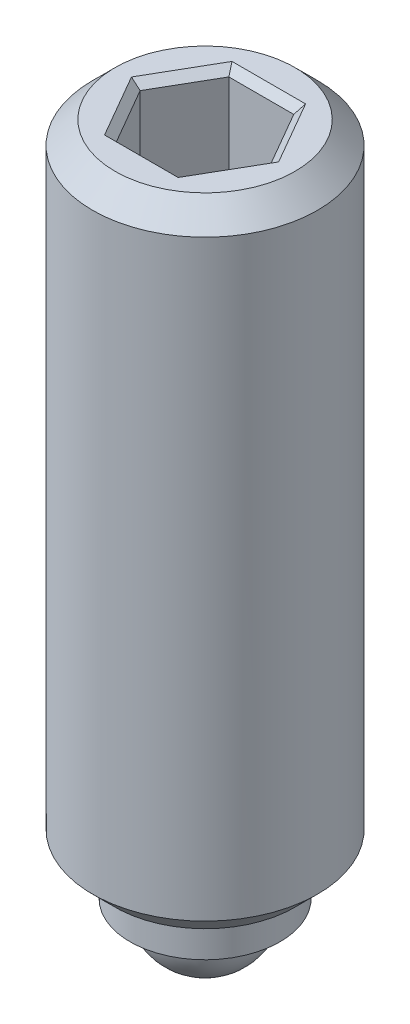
ISO-10303-21;
HEADER;
FILE_DESCRIPTION(('STEP AP214'),'2;1');
FILE_NAME('part.step','',(''),(''),'','','');
FILE_SCHEMA(('AUTOMOTIVE_DESIGN { 1 0 10303 214 1 1 1 1 }'));
ENDSEC;
DATA;
#1=APPLICATION_CONTEXT('core data for automotive mechanical design processes');
#2=APPLICATION_PROTOCOL_DEFINITION('international standard','automotive_design',2000,#1);
#3=PRODUCT_CONTEXT('',#1,'mechanical');
#4=PRODUCT('Part','Part','',(#3));
#5=PRODUCT_RELATED_PRODUCT_CATEGORY('part','',(#4));
#6=PRODUCT_DEFINITION_FORMATION('','',#4);
#7=PRODUCT_DEFINITION_CONTEXT('part definition',#1,'design');
#8=PRODUCT_DEFINITION('design','',#6,#7);
#9=PRODUCT_DEFINITION_SHAPE('','',#8);
#10=(LENGTH_UNIT() NAMED_UNIT(*) SI_UNIT(.MILLI.,.METRE.));
#11=(NAMED_UNIT(*) PLANE_ANGLE_UNIT() SI_UNIT($,.RADIAN.));
#12=(NAMED_UNIT(*) SI_UNIT($,.STERADIAN.) SOLID_ANGLE_UNIT());
#13=UNCERTAINTY_MEASURE_WITH_UNIT(LENGTH_MEASURE(1.E-05),#10,'distance_accuracy_value','');
#14=(GEOMETRIC_REPRESENTATION_CONTEXT(3) GLOBAL_UNCERTAINTY_ASSIGNED_CONTEXT((#13)) GLOBAL_UNIT_ASSIGNED_CONTEXT((#10,
#11,#12)) REPRESENTATION_CONTEXT('',''));
#15=CARTESIAN_POINT('',(0.,0.,0.));
#16=DIRECTION('',(0.,0.,1.));
#17=DIRECTION('',(1.,0.,0.));
#18=AXIS2_PLACEMENT_3D('',#15,#16,#17);
#19=CARTESIAN_POINT('',(1.,0.,0.));
#20=DIRECTION('',(0.,-1.,0.));
#21=DIRECTION('',(0.,0.,-1.));
#22=AXIS2_PLACEMENT_3D('',#19,#20,#21);
#23=PLANE('',#22);
#24=CARTESIAN_POINT('',(0.,0.,0.));
#25=DIRECTION('',(0.,-1.,0.));
#26=DIRECTION('',(0.,0.,-1.));
#27=AXIS2_PLACEMENT_3D('',#24,#25,#26);
#28=CIRCLE('',#27,0.75);
#29=CARTESIAN_POINT('',(0.,0.,-0.75));
#30=VERTEX_POINT('',#29);
#31=EDGE_CURVE('E166',#30,#30,#28,.T.);
#32=ORIENTED_EDGE('',*,*,#31,.F.);
#33=EDGE_LOOP('',(#32));
#34=FACE_BOUND('',#33,.T.);
#35=CARTESIAN_POINT('',(0.,0.,0.));
#36=DIRECTION('',(0.,-1.,0.));
#37=DIRECTION('',(0.,0.,-1.));
#38=AXIS2_PLACEMENT_3D('',#35,#36,#37);
#39=CIRCLE('',#38,1.);
#40=CARTESIAN_POINT('',(0.,0.,-1.));
#41=VERTEX_POINT('',#40);
#42=EDGE_CURVE('E152',#41,#41,#39,.T.);
#43=ORIENTED_EDGE('',*,*,#42,.T.);
#44=EDGE_LOOP('',(#43));
#45=FACE_BOUND('',#44,.T.);
#46=ADVANCED_FACE('F41',(#34,#45),#23,.T.);
#47=CARTESIAN_POINT('',(0.,9.,0.));
#48=DIRECTION('',(0.,1.,0.));
#49=DIRECTION('',(0.,0.,1.));
#50=AXIS2_PLACEMENT_3D('',#47,#48,#49);
#51=PLANE('',#50);
#52=DIRECTION('',(1.,0.,0.));
#53=VECTOR('',#52,1.);
#54=CARTESIAN_POINT('',(0.433012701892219,9.,-0.849999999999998));
#55=LINE('',#54,#53);
#56=CARTESIAN_POINT('',(-0.490747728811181,9.,-0.849999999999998));
#57=VERTEX_POINT('',#56);
#58=CARTESIAN_POINT('',(0.490747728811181,9.,-0.849999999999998));
#59=VERTEX_POINT('',#58);
#60=EDGE_CURVE('E191',#57,#59,#55,.T.);
#61=ORIENTED_EDGE('',*,*,#60,.T.);
#62=DIRECTION('',(0.5,0.,0.866025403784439));
#63=VECTOR('',#62,1.);
#64=CARTESIAN_POINT('',(0.952627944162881,9.,-0.0499999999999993));
#65=LINE('',#64,#63);
#66=CARTESIAN_POINT('',(0.981495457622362,9.,0.));
#67=VERTEX_POINT('',#66);
#68=EDGE_CURVE('E193',#59,#67,#65,.T.);
#69=ORIENTED_EDGE('',*,*,#68,.T.);
#70=DIRECTION('',(-0.5,0.,0.866025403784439));
#71=VECTOR('',#70,1.);
#72=CARTESIAN_POINT('',(0.519615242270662,9.,0.799999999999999));
#73=LINE('',#72,#71);
#74=CARTESIAN_POINT('',(0.490747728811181,9.,0.849999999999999));
#75=VERTEX_POINT('',#74);
#76=EDGE_CURVE('E183',#67,#75,#73,.T.);
#77=ORIENTED_EDGE('',*,*,#76,.T.);
#78=DIRECTION('',(-1.,0.,0.));
#79=VECTOR('',#78,1.);
#80=CARTESIAN_POINT('',(-0.433012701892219,9.,0.849999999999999));
#81=LINE('',#80,#79);
#82=CARTESIAN_POINT('',(-0.49074772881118,9.,0.849999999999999));
#83=VERTEX_POINT('',#82);
#84=EDGE_CURVE('E185',#75,#83,#81,.T.);
#85=ORIENTED_EDGE('',*,*,#84,.T.);
#86=DIRECTION('',(-0.5,0.,-0.866025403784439));
#87=VECTOR('',#86,1.);
#88=CARTESIAN_POINT('',(-0.952627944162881,9.,0.0499999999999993));
#89=LINE('',#88,#87);
#90=CARTESIAN_POINT('',(-0.981495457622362,9.,0.));
#91=VERTEX_POINT('',#90);
#92=EDGE_CURVE('E187',#83,#91,#89,.T.);
#93=ORIENTED_EDGE('',*,*,#92,.T.);
#94=DIRECTION('',(0.5,0.,-0.866025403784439));
#95=VECTOR('',#94,1.);
#96=CARTESIAN_POINT('',(-0.519615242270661,9.,-0.799999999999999));
#97=LINE('',#96,#95);
#98=EDGE_CURVE('E189',#91,#57,#97,.T.);
#99=ORIENTED_EDGE('',*,*,#98,.T.);
#100=EDGE_LOOP('',(#61,#69,#77,#85,#93,#99));
#101=FACE_BOUND('',#100,.T.);
#102=CARTESIAN_POINT('',(0.,9.,0.));
#103=DIRECTION('',(0.,1.,0.));
#104=DIRECTION('',(0.,0.,1.));
#105=AXIS2_PLACEMENT_3D('',#102,#103,#104);
#106=CIRCLE('',#105,1.2);
#107=CARTESIAN_POINT('',(0.,9.,1.2));
#108=VERTEX_POINT('',#107);
#109=EDGE_CURVE('E172',#108,#108,#106,.T.);
#110=ORIENTED_EDGE('',*,*,#109,.T.);
#111=EDGE_LOOP('',(#110));
#112=FACE_BOUND('',#111,.T.);
#113=ADVANCED_FACE('F253',(#101,#112),#51,.T.);
#114=CARTESIAN_POINT('',(0.,0.,0.));
#115=DIRECTION('',(0.,-1.,0.));
#116=DIRECTION('',(0.,0.,-1.));
#117=AXIS2_PLACEMENT_3D('',#114,#115,#116);
#118=CYLINDRICAL_SURFACE('',#117,1.5);
#119=CARTESIAN_POINT('',(0.,0.799999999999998,0.));
#120=DIRECTION('',(0.,-1.,0.));
#121=DIRECTION('',(0.,0.,-1.));
#122=AXIS2_PLACEMENT_3D('',#119,#120,#121);
#123=CIRCLE('',#122,1.5);
#124=CARTESIAN_POINT('',(0.,0.799999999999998,-1.5));
#125=VERTEX_POINT('',#124);
#126=EDGE_CURVE('E178',#125,#125,#123,.F.);
#127=ORIENTED_EDGE('',*,*,#126,.T.);
#128=EDGE_LOOP('',(#127));
#129=FACE_BOUND('',#128,.T.);
#130=CARTESIAN_POINT('',(0.,8.7,0.));
#131=DIRECTION('',(0.,1.,0.));
#132=DIRECTION('',(0.,0.,1.));
#133=AXIS2_PLACEMENT_3D('',#130,#131,#132);
#134=CIRCLE('',#133,1.5);
#135=CARTESIAN_POINT('',(0.,8.7,1.5));
#136=VERTEX_POINT('',#135);
#137=EDGE_CURVE('E169',#136,#136,#134,.F.);
#138=ORIENTED_EDGE('',*,*,#137,.T.);
#139=EDGE_LOOP('',(#138));
#140=FACE_BOUND('',#139,.T.);
#141=ADVANCED_FACE('F259',(#129,#140),#118,.T.);
#142=CARTESIAN_POINT('',(1.5,0.5,0.));
#143=DIRECTION('',(0.,-1.,0.));
#144=DIRECTION('',(0.,0.,-1.));
#145=AXIS2_PLACEMENT_3D('',#142,#143,#144);
#146=PLANE('',#145);
#147=CARTESIAN_POINT('',(0.,0.5,0.));
#148=DIRECTION('',(0.,-1.,0.));
#149=DIRECTION('',(0.,0.,-1.));
#150=AXIS2_PLACEMENT_3D('',#147,#148,#149);
#151=CIRCLE('',#150,1.2);
#152=CARTESIAN_POINT('',(0.,0.5,-1.2));
#153=VERTEX_POINT('',#152);
#154=EDGE_CURVE('E175',#153,#153,#151,.T.);
#155=ORIENTED_EDGE('',*,*,#154,.T.);
#156=EDGE_LOOP('',(#155));
#157=FACE_BOUND('',#156,.T.);
#158=CARTESIAN_POINT('',(0.,0.5,0.));
#159=DIRECTION('',(0.,-1.,0.));
#160=DIRECTION('',(0.,0.,-1.));
#161=AXIS2_PLACEMENT_3D('',#158,#159,#160);
#162=CIRCLE('',#161,1.);
#163=CARTESIAN_POINT('',(0.,0.5,-1.));
#164=VERTEX_POINT('',#163);
#165=EDGE_CURVE('E163',#164,#164,#162,.T.);
#166=ORIENTED_EDGE('',*,*,#165,.F.);
#167=EDGE_LOOP('',(#166));
#168=FACE_BOUND('',#167,.T.);
#169=ADVANCED_FACE('F327',(#157,#168),#146,.T.);
#170=CARTESIAN_POINT('',(0.,0.,0.));
#171=DIRECTION('',(0.,-1.,0.));
#172=DIRECTION('',(0.,0.,-1.));
#173=AXIS2_PLACEMENT_3D('',#170,#171,#172);
#174=CYLINDRICAL_SURFACE('',#173,1.);
#175=ORIENTED_EDGE('',*,*,#165,.T.);
#176=EDGE_LOOP('',(#175));
#177=FACE_BOUND('',#176,.T.);
#178=ORIENTED_EDGE('',*,*,#42,.F.);
#179=EDGE_LOOP('',(#178));
#180=FACE_BOUND('',#179,.T.);
#181=ADVANCED_FACE('F323',(#177,#180),#174,.T.);
#182=CARTESIAN_POINT('',(0.,0.,0.));
#183=DIRECTION('',(0.,-1.,0.));
#184=DIRECTION('',(-1.,0.,0.));
#185=AXIS2_PLACEMENT_3D('',#182,#183,#184);
#186=SPHERICAL_SURFACE('',#185,0.75);
#187=ORIENTED_EDGE('',*,*,#31,.T.);
#188=EDGE_LOOP('',(#187));
#189=FACE_BOUND('',#188,.T.);
#190=ADVANCED_FACE('F273',(#189),#186,.T.);
#191=CARTESIAN_POINT('',(0.,8.7,0.));
#192=DIRECTION('',(0.,-1.,0.));
#193=DIRECTION('',(0.,0.,-1.));
#194=AXIS2_PLACEMENT_3D('',#191,#192,#193);
#195=CONICAL_SURFACE('',#194,1.5,0.785398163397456);
#196=ORIENTED_EDGE('',*,*,#109,.F.);
#197=EDGE_LOOP('',(#196));
#198=FACE_BOUND('',#197,.T.);
#199=ORIENTED_EDGE('',*,*,#137,.F.);
#200=EDGE_LOOP('',(#199));
#201=FACE_BOUND('',#200,.T.);
#202=ADVANCED_FACE('F267',(#198,#201),#195,.T.);
#203=CARTESIAN_POINT('',(0.,0.5,0.));
#204=DIRECTION('',(0.,1.,0.));
#205=DIRECTION('',(0.,0.,1.));
#206=AXIS2_PLACEMENT_3D('',#203,#204,#205);
#207=CONICAL_SURFACE('',#206,1.2,0.785398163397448);
#208=ORIENTED_EDGE('',*,*,#126,.F.);
#209=EDGE_LOOP('',(#208));
#210=FACE_BOUND('',#209,.T.);
#211=ORIENTED_EDGE('',*,*,#154,.F.);
#212=EDGE_LOOP('',(#211));
#213=FACE_BOUND('',#212,.T.);
#214=ADVANCED_FACE('F249',(#210,#213),#207,.T.);
#215=CARTESIAN_POINT('',(0.433012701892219,6.,0.75));
#216=DIRECTION('',(0.866025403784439,0.,0.5));
#217=DIRECTION('',(0.5,0.,-0.866025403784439));
#218=AXIS2_PLACEMENT_3D('',#215,#216,#217);
#219=PLANE('',#218);
#220=DIRECTION('',(0.,1.,0.));
#221=VECTOR('',#220,1.);
#222=CARTESIAN_POINT('',(0.433012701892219,6.,0.75));
#223=LINE('',#222,#221);
#224=CARTESIAN_POINT('',(0.433012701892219,6.,0.75));
#225=VERTEX_POINT('',#224);
#226=CARTESIAN_POINT('',(0.433012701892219,8.9,0.75));
#227=VERTEX_POINT('',#226);
#228=EDGE_CURVE('E150',#225,#227,#223,.T.);
#229=ORIENTED_EDGE('',*,*,#228,.T.);
#230=DIRECTION('',(0.5,0.,-0.866025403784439));
#231=VECTOR('',#230,1.);
#232=CARTESIAN_POINT('',(0.866025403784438,8.9,0.));
#233=LINE('',#232,#231);
#234=CARTESIAN_POINT('',(0.866025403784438,8.9,0.));
#235=VERTEX_POINT('',#234);
#236=EDGE_CURVE('E11',#227,#235,#233,.T.);
#237=ORIENTED_EDGE('',*,*,#236,.T.);
#238=DIRECTION('',(0.,1.,0.));
#239=VECTOR('',#238,1.);
#240=CARTESIAN_POINT('',(0.866025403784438,6.,0.));
#241=LINE('',#240,#239);
#242=CARTESIAN_POINT('',(0.866025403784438,6.,0.));
#243=VERTEX_POINT('',#242);
#244=EDGE_CURVE('E114',#243,#235,#241,.T.);
#245=ORIENTED_EDGE('',*,*,#244,.F.);
#246=DIRECTION('',(0.5,0.,-0.866025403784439));
#247=VECTOR('',#246,1.);
#248=CARTESIAN_POINT('',(0.433012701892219,6.,0.75));
#249=LINE('',#248,#247);
#250=EDGE_CURVE('E118',#225,#243,#249,.T.);
#251=ORIENTED_EDGE('',*,*,#250,.F.);
#252=EDGE_LOOP('',(#229,#237,#245,#251));
#253=FACE_BOUND('',#252,.T.);
#254=ADVANCED_FACE('F116',(#253),#219,.F.);
#255=CARTESIAN_POINT('',(-0.433012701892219,6.,0.75));
#256=DIRECTION('',(0.,0.,1.));
#257=DIRECTION('',(1.,0.,0.));
#258=AXIS2_PLACEMENT_3D('',#255,#256,#257);
#259=PLANE('',#258);
#260=DIRECTION('',(0.,1.,0.));
#261=VECTOR('',#260,1.);
#262=CARTESIAN_POINT('',(-0.433012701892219,6.,0.75));
#263=LINE('',#262,#261);
#264=CARTESIAN_POINT('',(-0.433012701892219,6.,0.75));
#265=VERTEX_POINT('',#264);
#266=CARTESIAN_POINT('',(-0.433012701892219,8.9,0.75));
#267=VERTEX_POINT('',#266);
#268=EDGE_CURVE('E153',#265,#267,#263,.T.);
#269=ORIENTED_EDGE('',*,*,#268,.T.);
#270=DIRECTION('',(1.,0.,0.));
#271=VECTOR('',#270,1.);
#272=CARTESIAN_POINT('',(0.433012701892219,8.9,0.75));
#273=LINE('',#272,#271);
#274=EDGE_CURVE('E51',#267,#227,#273,.T.);
#275=ORIENTED_EDGE('',*,*,#274,.T.);
#276=ORIENTED_EDGE('',*,*,#228,.F.);
#277=DIRECTION('',(1.,0.,0.));
#278=VECTOR('',#277,1.);
#279=CARTESIAN_POINT('',(-0.433012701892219,6.,0.75));
#280=LINE('',#279,#278);
#281=EDGE_CURVE('E125',#265,#225,#280,.T.);
#282=ORIENTED_EDGE('',*,*,#281,.F.);
#283=EDGE_LOOP('',(#269,#275,#276,#282));
#284=FACE_BOUND('',#283,.T.);
#285=ADVANCED_FACE('F241',(#284),#259,.F.);
#286=CARTESIAN_POINT('',(-0.866025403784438,6.,0.));
#287=DIRECTION('',(-0.866025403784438,0.,0.5));
#288=DIRECTION('',(0.5,0.,0.866025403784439));
#289=AXIS2_PLACEMENT_3D('',#286,#287,#288);
#290=PLANE('',#289);
#291=DIRECTION('',(0.,1.,0.));
#292=VECTOR('',#291,1.);
#293=CARTESIAN_POINT('',(-0.866025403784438,6.,0.));
#294=LINE('',#293,#292);
#295=CARTESIAN_POINT('',(-0.866025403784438,6.,0.));
#296=VERTEX_POINT('',#295);
#297=CARTESIAN_POINT('',(-0.866025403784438,8.9,0.));
#298=VERTEX_POINT('',#297);
#299=EDGE_CURVE('E155',#296,#298,#294,.T.);
#300=ORIENTED_EDGE('',*,*,#299,.T.);
#301=DIRECTION('',(0.5,0.,0.866025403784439));
#302=VECTOR('',#301,1.);
#303=CARTESIAN_POINT('',(-0.433012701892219,8.9,0.75));
#304=LINE('',#303,#302);
#305=EDGE_CURVE('E66',#298,#267,#304,.T.);
#306=ORIENTED_EDGE('',*,*,#305,.T.);
#307=ORIENTED_EDGE('',*,*,#268,.F.);
#308=DIRECTION('',(0.5,0.,0.866025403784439));
#309=VECTOR('',#308,1.);
#310=CARTESIAN_POINT('',(-0.866025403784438,6.,0.));
#311=LINE('',#310,#309);
#312=EDGE_CURVE('E147',#296,#265,#311,.T.);
#313=ORIENTED_EDGE('',*,*,#312,.F.);
#314=EDGE_LOOP('',(#300,#306,#307,#313));
#315=FACE_BOUND('',#314,.T.);
#316=ADVANCED_FACE('F240',(#315),#290,.F.);
#317=CARTESIAN_POINT('',(-0.433012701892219,6.,-0.75));
#318=DIRECTION('',(-0.866025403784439,0.,-0.5));
#319=DIRECTION('',(-0.5,0.,0.866025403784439));
#320=AXIS2_PLACEMENT_3D('',#317,#318,#319);
#321=PLANE('',#320);
#322=DIRECTION('',(0.,1.,0.));
#323=VECTOR('',#322,1.);
#324=CARTESIAN_POINT('',(-0.433012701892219,6.,-0.75));
#325=LINE('',#324,#323);
#326=CARTESIAN_POINT('',(-0.433012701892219,6.,-0.75));
#327=VERTEX_POINT('',#326);
#328=CARTESIAN_POINT('',(-0.433012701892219,8.9,-0.75));
#329=VERTEX_POINT('',#328);
#330=EDGE_CURVE('E157',#327,#329,#325,.T.);
#331=ORIENTED_EDGE('',*,*,#330,.T.);
#332=DIRECTION('',(-0.5,0.,0.866025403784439));
#333=VECTOR('',#332,1.);
#334=CARTESIAN_POINT('',(-0.866025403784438,8.9,0.));
#335=LINE('',#334,#333);
#336=EDGE_CURVE('E198',#329,#298,#335,.T.);
#337=ORIENTED_EDGE('',*,*,#336,.T.);
#338=ORIENTED_EDGE('',*,*,#299,.F.);
#339=DIRECTION('',(-0.5,0.,0.866025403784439));
#340=VECTOR('',#339,1.);
#341=CARTESIAN_POINT('',(-0.433012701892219,6.,-0.75));
#342=LINE('',#341,#340);
#343=EDGE_CURVE('E144',#327,#296,#342,.T.);
#344=ORIENTED_EDGE('',*,*,#343,.F.);
#345=EDGE_LOOP('',(#331,#337,#338,#344));
#346=FACE_BOUND('',#345,.T.);
#347=ADVANCED_FACE('F239',(#346),#321,.F.);
#348=CARTESIAN_POINT('',(0.433012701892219,6.,-0.75));
#349=DIRECTION('',(0.,0.,-1.));
#350=DIRECTION('',(-1.,0.,0.));
#351=AXIS2_PLACEMENT_3D('',#348,#349,#350);
#352=PLANE('',#351);
#353=DIRECTION('',(0.,1.,0.));
#354=VECTOR('',#353,1.);
#355=CARTESIAN_POINT('',(0.433012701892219,6.,-0.75));
#356=LINE('',#355,#354);
#357=CARTESIAN_POINT('',(0.433012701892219,6.,-0.75));
#358=VERTEX_POINT('',#357);
#359=CARTESIAN_POINT('',(0.433012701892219,8.9,-0.75));
#360=VERTEX_POINT('',#359);
#361=EDGE_CURVE('E124',#358,#360,#356,.T.);
#362=ORIENTED_EDGE('',*,*,#361,.T.);
#363=DIRECTION('',(-1.,0.,0.));
#364=VECTOR('',#363,1.);
#365=CARTESIAN_POINT('',(-0.433012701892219,8.9,-0.75));
#366=LINE('',#365,#364);
#367=EDGE_CURVE('E196',#360,#329,#366,.T.);
#368=ORIENTED_EDGE('',*,*,#367,.T.);
#369=ORIENTED_EDGE('',*,*,#330,.F.);
#370=DIRECTION('',(-1.,0.,0.));
#371=VECTOR('',#370,1.);
#372=CARTESIAN_POINT('',(0.433012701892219,6.,-0.75));
#373=LINE('',#372,#371);
#374=EDGE_CURVE('E134',#358,#327,#373,.T.);
#375=ORIENTED_EDGE('',*,*,#374,.F.);
#376=EDGE_LOOP('',(#362,#368,#369,#375));
#377=FACE_BOUND('',#376,.T.);
#378=ADVANCED_FACE('F235',(#377),#352,.F.);
#379=CARTESIAN_POINT('',(0.866025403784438,6.,0.));
#380=DIRECTION('',(0.866025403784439,0.,-0.5));
#381=DIRECTION('',(-0.5,0.,-0.866025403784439));
#382=AXIS2_PLACEMENT_3D('',#379,#380,#381);
#383=PLANE('',#382);
#384=ORIENTED_EDGE('',*,*,#244,.T.);
#385=DIRECTION('',(-0.5,0.,-0.866025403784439));
#386=VECTOR('',#385,1.);
#387=CARTESIAN_POINT('',(0.433012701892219,8.9,-0.75));
#388=LINE('',#387,#386);
#389=EDGE_CURVE('E181',#235,#360,#388,.T.);
#390=ORIENTED_EDGE('',*,*,#389,.T.);
#391=ORIENTED_EDGE('',*,*,#361,.F.);
#392=DIRECTION('',(-0.5,0.,-0.866025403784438));
#393=VECTOR('',#392,1.);
#394=CARTESIAN_POINT('',(0.866025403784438,6.,0.));
#395=LINE('',#394,#393);
#396=EDGE_CURVE('E128',#243,#358,#395,.T.);
#397=ORIENTED_EDGE('',*,*,#396,.F.);
#398=EDGE_LOOP('',(#384,#390,#391,#397));
#399=FACE_BOUND('',#398,.T.);
#400=ADVANCED_FACE('F129',(#399),#383,.F.);
#401=CARTESIAN_POINT('',(0.,6.,0.));
#402=DIRECTION('',(0.,1.,0.));
#403=DIRECTION('',(0.,0.,1.));
#404=AXIS2_PLACEMENT_3D('',#401,#402,#403);
#405=PLANE('',#404);
#406=ORIENTED_EDGE('',*,*,#250,.T.);
#407=ORIENTED_EDGE('',*,*,#396,.T.);
#408=ORIENTED_EDGE('',*,*,#374,.T.);
#409=ORIENTED_EDGE('',*,*,#343,.T.);
#410=ORIENTED_EDGE('',*,*,#312,.T.);
#411=ORIENTED_EDGE('',*,*,#281,.T.);
#412=EDGE_LOOP('',(#406,#407,#408,#409,#410,#411));
#413=FACE_BOUND('',#412,.T.);
#414=ADVANCED_FACE('F136',(#413),#405,.T.);
#415=CARTESIAN_POINT('',(-0.866025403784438,8.9,0.));
#416=DIRECTION('',(0.612372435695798,0.707106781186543,-0.353553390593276));
#417=DIRECTION('',(-0.5,0.,-0.866025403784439));
#418=AXIS2_PLACEMENT_3D('',#415,#416,#417);
#419=PLANE('',#418);
#420=DIRECTION('',(-0.755928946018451,0.654653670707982,0.));
#421=VECTOR('',#420,1.);
#422=CARTESIAN_POINT('',(-0.618589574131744,8.68571428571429,0.));
#423=LINE('',#422,#421);
#424=EDGE_CURVE('E141',#91,#298,#423,.F.);
#425=ORIENTED_EDGE('',*,*,#424,.F.);
#426=ORIENTED_EDGE('',*,*,#92,.F.);
#427=DIRECTION('',(-0.377964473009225,0.654653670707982,0.654653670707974));
#428=VECTOR('',#427,1.);
#429=CARTESIAN_POINT('',(-0.309294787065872,8.68571428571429,0.535714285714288));
#430=LINE('',#429,#428);
#431=EDGE_CURVE('E46',#267,#83,#430,.T.);
#432=ORIENTED_EDGE('',*,*,#431,.F.);
#433=ORIENTED_EDGE('',*,*,#305,.F.);
#434=EDGE_LOOP('',(#425,#426,#432,#433));
#435=FACE_BOUND('',#434,.T.);
#436=ADVANCED_FACE('F44',(#435),#419,.T.);
#437=CARTESIAN_POINT('',(-0.433012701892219,8.9,0.75));
#438=DIRECTION('',(0.,0.707106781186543,-0.707106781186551));
#439=DIRECTION('',(-1.,0.,0.));
#440=AXIS2_PLACEMENT_3D('',#437,#438,#439);
#441=PLANE('',#440);
#442=ORIENTED_EDGE('',*,*,#431,.T.);
#443=ORIENTED_EDGE('',*,*,#84,.F.);
#444=DIRECTION('',(0.377964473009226,0.654653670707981,0.654653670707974));
#445=VECTOR('',#444,1.);
#446=CARTESIAN_POINT('',(0.309294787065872,8.68571428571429,0.535714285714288));
#447=LINE('',#446,#445);
#448=EDGE_CURVE('E209',#227,#75,#447,.T.);
#449=ORIENTED_EDGE('',*,*,#448,.F.);
#450=ORIENTED_EDGE('',*,*,#274,.F.);
#451=EDGE_LOOP('',(#442,#443,#449,#450));
#452=FACE_BOUND('',#451,.T.);
#453=ADVANCED_FACE('F224',(#452),#441,.T.);
#454=CARTESIAN_POINT('',(-0.433012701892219,8.9,-0.75));
#455=DIRECTION('',(0.612372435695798,0.707106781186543,0.353553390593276));
#456=DIRECTION('',(0.5,0.,-0.866025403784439));
#457=AXIS2_PLACEMENT_3D('',#454,#455,#456);
#458=PLANE('',#457);
#459=ORIENTED_EDGE('',*,*,#424,.T.);
#460=ORIENTED_EDGE('',*,*,#336,.F.);
#461=DIRECTION('',(-0.377964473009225,0.654653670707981,-0.654653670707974));
#462=VECTOR('',#461,1.);
#463=CARTESIAN_POINT('',(-0.309294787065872,8.68571428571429,-0.535714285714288));
#464=LINE('',#463,#462);
#465=EDGE_CURVE('E206',#57,#329,#464,.F.);
#466=ORIENTED_EDGE('',*,*,#465,.F.);
#467=ORIENTED_EDGE('',*,*,#98,.F.);
#468=EDGE_LOOP('',(#459,#460,#466,#467));
#469=FACE_BOUND('',#468,.T.);
#470=ADVANCED_FACE('F216',(#469),#458,.T.);
#471=CARTESIAN_POINT('',(0.433012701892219,8.9,0.75));
#472=DIRECTION('',(-0.612372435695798,0.707106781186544,-0.353553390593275));
#473=DIRECTION('',(-0.5,0.,0.866025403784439));
#474=AXIS2_PLACEMENT_3D('',#471,#472,#473);
#475=PLANE('',#474);
#476=ORIENTED_EDGE('',*,*,#448,.T.);
#477=ORIENTED_EDGE('',*,*,#76,.F.);
#478=DIRECTION('',(-0.755928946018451,-0.654653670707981,0.));
#479=VECTOR('',#478,1.);
#480=CARTESIAN_POINT('',(0.866025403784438,8.9,0.));
#481=LINE('',#480,#479);
#482=EDGE_CURVE('E204',#235,#67,#481,.F.);
#483=ORIENTED_EDGE('',*,*,#482,.F.);
#484=ORIENTED_EDGE('',*,*,#236,.F.);
#485=EDGE_LOOP('',(#476,#477,#483,#484));
#486=FACE_BOUND('',#485,.T.);
#487=ADVANCED_FACE('F227',(#486),#475,.T.);
#488=CARTESIAN_POINT('',(0.433012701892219,8.9,-0.75));
#489=DIRECTION('',(0.,0.707106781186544,0.707106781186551));
#490=DIRECTION('',(1.,0.,0.));
#491=AXIS2_PLACEMENT_3D('',#488,#489,#490);
#492=PLANE('',#491);
#493=ORIENTED_EDGE('',*,*,#465,.T.);
#494=ORIENTED_EDGE('',*,*,#367,.F.);
#495=DIRECTION('',(0.377964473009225,0.654653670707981,-0.654653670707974));
#496=VECTOR('',#495,1.);
#497=CARTESIAN_POINT('',(0.309294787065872,8.68571428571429,-0.535714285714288));
#498=LINE('',#497,#496);
#499=EDGE_CURVE('E202',#59,#360,#498,.F.);
#500=ORIENTED_EDGE('',*,*,#499,.F.);
#501=ORIENTED_EDGE('',*,*,#60,.F.);
#502=EDGE_LOOP('',(#493,#494,#500,#501));
#503=FACE_BOUND('',#502,.T.);
#504=ADVANCED_FACE('F286',(#503),#492,.T.);
#505=CARTESIAN_POINT('',(0.866025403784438,8.9,0.));
#506=DIRECTION('',(-0.612372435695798,0.707106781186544,0.353553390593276));
#507=DIRECTION('',(0.5,0.,0.866025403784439));
#508=AXIS2_PLACEMENT_3D('',#505,#506,#507);
#509=PLANE('',#508);
#510=ORIENTED_EDGE('',*,*,#482,.T.);
#511=ORIENTED_EDGE('',*,*,#68,.F.);
#512=ORIENTED_EDGE('',*,*,#499,.T.);
#513=ORIENTED_EDGE('',*,*,#389,.F.);
#514=EDGE_LOOP('',(#510,#511,#512,#513));
#515=FACE_BOUND('',#514,.T.);
#516=ADVANCED_FACE('F231',(#515),#509,.T.);
#517=CLOSED_SHELL('',(#46,#113,#141,#169,#181,#190,#202,#214,#254,#285,#316,#347,#378,#400,#414,
#436,#453,#470,#487,#504,#516));
#518=MANIFOLD_SOLID_BREP('B2',#517);
#519=ADVANCED_BREP_SHAPE_REPRESENTATION('',(#18,#518),#14);
#520=SHAPE_DEFINITION_REPRESENTATION(#9,#519);
ENDSEC;
END-ISO-10303-21;
